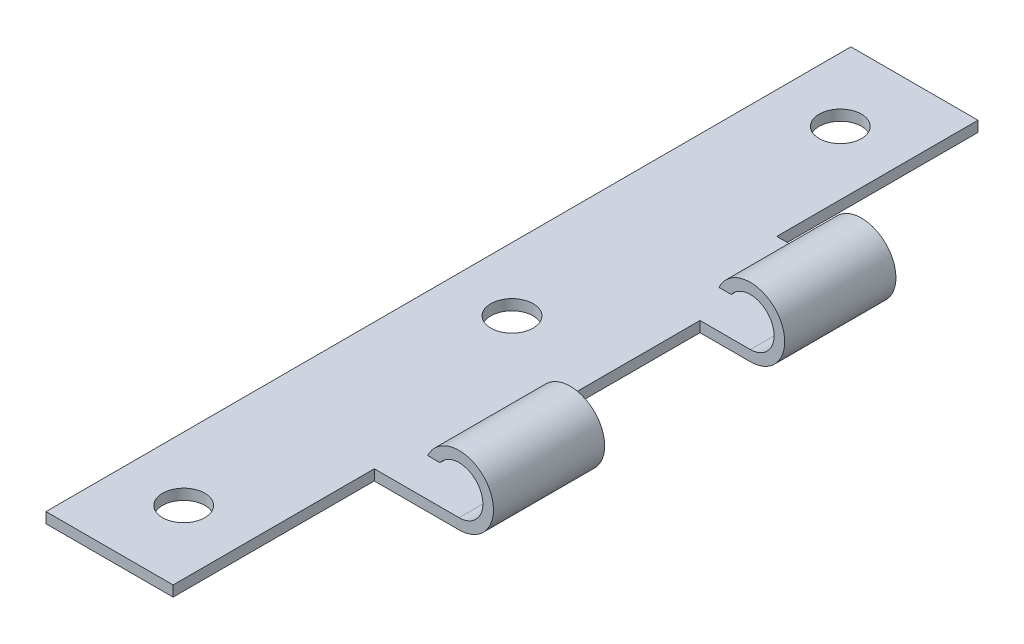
ISO-10303-21;
HEADER;
FILE_DESCRIPTION(('STEP AP214'),'2;1');
FILE_NAME('part.step','',(''),(''),'','','');
FILE_SCHEMA(('AUTOMOTIVE_DESIGN { 1 0 10303 214 1 1 1 1 }'));
ENDSEC;
DATA;
#1=APPLICATION_CONTEXT('core data for automotive mechanical design processes');
#2=APPLICATION_PROTOCOL_DEFINITION('international standard','automotive_design',2000,#1);
#3=PRODUCT_CONTEXT('',#1,'mechanical');
#4=PRODUCT('Part','Part','',(#3));
#5=PRODUCT_RELATED_PRODUCT_CATEGORY('part','',(#4));
#6=PRODUCT_DEFINITION_FORMATION('','',#4);
#7=PRODUCT_DEFINITION_CONTEXT('part definition',#1,'design');
#8=PRODUCT_DEFINITION('design','',#6,#7);
#9=PRODUCT_DEFINITION_SHAPE('','',#8);
#10=(LENGTH_UNIT() NAMED_UNIT(*) SI_UNIT(.MILLI.,.METRE.));
#11=(NAMED_UNIT(*) PLANE_ANGLE_UNIT() SI_UNIT($,.RADIAN.));
#12=(NAMED_UNIT(*) SI_UNIT($,.STERADIAN.) SOLID_ANGLE_UNIT());
#13=UNCERTAINTY_MEASURE_WITH_UNIT(LENGTH_MEASURE(1.E-05),#10,'distance_accuracy_value','');
#14=(GEOMETRIC_REPRESENTATION_CONTEXT(3) GLOBAL_UNCERTAINTY_ASSIGNED_CONTEXT((#13)) GLOBAL_UNIT_ASSIGNED_CONTEXT((#10,
#11,#12)) REPRESENTATION_CONTEXT('',''));
#15=CARTESIAN_POINT('',(0.,0.,0.));
#16=DIRECTION('',(0.,0.,1.));
#17=DIRECTION('',(1.,0.,0.));
#18=AXIS2_PLACEMENT_3D('',#15,#16,#17);
#19=CARTESIAN_POINT('',(-20.,-2.25,58.0249843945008));
#20=DIRECTION('',(0.,-1.,0.));
#21=DIRECTION('',(0.,0.,-1.));
#22=AXIS2_PLACEMENT_3D('',#19,#20,#21);
#23=PLANE('',#22);
#24=CARTESIAN_POINT('',(-14.,-2.25,-31.));
#25=DIRECTION('',(0.,1.,0.));
#26=DIRECTION('',(0.,0.,1.));
#27=AXIS2_PLACEMENT_3D('',#24,#25,#26);
#28=CIRCLE('',#27,2.);
#29=CARTESIAN_POINT('',(-14.,-2.25,-29.));
#30=VERTEX_POINT('',#29);
#31=EDGE_CURVE('E466',#30,#30,#28,.T.);
#32=ORIENTED_EDGE('',*,*,#31,.F.);
#33=EDGE_LOOP('',(#32));
#34=FACE_BOUND('',#33,.T.);
#35=CARTESIAN_POINT('',(-14.,-2.25,0.));
#36=DIRECTION('',(0.,1.,0.));
#37=DIRECTION('',(0.,0.,1.));
#38=AXIS2_PLACEMENT_3D('',#35,#36,#37);
#39=CIRCLE('',#38,2.);
#40=CARTESIAN_POINT('',(-14.,-2.25,2.));
#41=VERTEX_POINT('',#40);
#42=EDGE_CURVE('E468',#41,#41,#39,.T.);
#43=ORIENTED_EDGE('',*,*,#42,.F.);
#44=EDGE_LOOP('',(#43));
#45=FACE_BOUND('',#44,.T.);
#46=DIRECTION('',(-1.,0.,0.));
#47=VECTOR('',#46,1.);
#48=CARTESIAN_POINT('',(-20.,-2.25,38.));
#49=LINE('',#48,#47);
#50=CARTESIAN_POINT('',(-8.,-2.25,38.));
#51=VERTEX_POINT('',#50);
#52=CARTESIAN_POINT('',(-20.,-2.25,38.));
#53=VERTEX_POINT('',#52);
#54=EDGE_CURVE('E174',#51,#53,#49,.T.);
#55=ORIENTED_EDGE('',*,*,#54,.F.);
#56=DIRECTION('',(0.,0.,-1.));
#57=VECTOR('',#56,1.);
#58=CARTESIAN_POINT('',(-8.,-2.25,58.0249843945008));
#59=LINE('',#58,#57);
#60=CARTESIAN_POINT('',(-8.,-2.25,19.));
#61=VERTEX_POINT('',#60);
#62=EDGE_CURVE('E148',#51,#61,#59,.T.);
#63=ORIENTED_EDGE('',*,*,#62,.T.);
#64=DIRECTION('',(1.,0.,0.));
#65=VECTOR('',#64,1.);
#66=CARTESIAN_POINT('',(-20.,-2.25,19.));
#67=LINE('',#66,#65);
#68=CARTESIAN_POINT('',(0.,-2.25,19.));
#69=VERTEX_POINT('',#68);
#70=EDGE_CURVE('E152',#61,#69,#67,.T.);
#71=ORIENTED_EDGE('',*,*,#70,.T.);
#72=DIRECTION('',(0.,0.,1.));
#73=VECTOR('',#72,1.);
#74=CARTESIAN_POINT('',(0.,-2.25,-38.001));
#75=LINE('',#74,#73);
#76=CARTESIAN_POINT('',(0.,-2.25,8.5));
#77=VERTEX_POINT('',#76);
#78=EDGE_CURVE('E230',#77,#69,#75,.T.);
#79=ORIENTED_EDGE('',*,*,#78,.F.);
#80=DIRECTION('',(-1.,0.,0.));
#81=VECTOR('',#80,1.);
#82=CARTESIAN_POINT('',(-20.,-2.25,8.5));
#83=LINE('',#82,#81);
#84=CARTESIAN_POINT('',(-4.75,-2.25,8.5));
#85=VERTEX_POINT('',#84);
#86=EDGE_CURVE('E283',#77,#85,#83,.T.);
#87=ORIENTED_EDGE('',*,*,#86,.T.);
#88=DIRECTION('',(0.,0.,-1.));
#89=VECTOR('',#88,1.);
#90=CARTESIAN_POINT('',(-4.75000000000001,-2.25,58.0249843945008));
#91=LINE('',#90,#89);
#92=CARTESIAN_POINT('',(-4.75,-2.25,-8.5));
#93=VERTEX_POINT('',#92);
#94=EDGE_CURVE('E289',#85,#93,#91,.T.);
#95=ORIENTED_EDGE('',*,*,#94,.T.);
#96=DIRECTION('',(1.,0.,0.));
#97=VECTOR('',#96,1.);
#98=CARTESIAN_POINT('',(-20.,-2.25,-8.5));
#99=LINE('',#98,#97);
#100=CARTESIAN_POINT('',(0.,-2.25,-8.5));
#101=VERTEX_POINT('',#100);
#102=EDGE_CURVE('E278',#93,#101,#99,.T.);
#103=ORIENTED_EDGE('',*,*,#102,.T.);
#104=CARTESIAN_POINT('',(0.,-2.25,-19.));
#105=VERTEX_POINT('',#104);
#106=EDGE_CURVE('E233',#105,#101,#75,.T.);
#107=ORIENTED_EDGE('',*,*,#106,.F.);
#108=DIRECTION('',(-1.,0.,0.));
#109=VECTOR('',#108,1.);
#110=CARTESIAN_POINT('',(-20.,-2.25,-19.));
#111=LINE('',#110,#109);
#112=CARTESIAN_POINT('',(-8.,-2.25,-19.));
#113=VERTEX_POINT('',#112);
#114=EDGE_CURVE('E227',#105,#113,#111,.T.);
#115=ORIENTED_EDGE('',*,*,#114,.T.);
#116=DIRECTION('',(0.,0.,-1.));
#117=VECTOR('',#116,1.);
#118=CARTESIAN_POINT('',(-8.,-2.25,58.0249843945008));
#119=LINE('',#118,#117);
#120=CARTESIAN_POINT('',(-8.,-2.25,-38.));
#121=VERTEX_POINT('',#120);
#122=EDGE_CURVE('E225',#113,#121,#119,.T.);
#123=ORIENTED_EDGE('',*,*,#122,.T.);
#124=DIRECTION('',(1.,0.,0.));
#125=VECTOR('',#124,1.);
#126=CARTESIAN_POINT('',(-20.,-2.25,-38.));
#127=LINE('',#126,#125);
#128=CARTESIAN_POINT('',(-20.,-2.25,-38.));
#129=VERTEX_POINT('',#128);
#130=EDGE_CURVE('E202',#129,#121,#127,.T.);
#131=ORIENTED_EDGE('',*,*,#130,.F.);
#132=DIRECTION('',(0.,0.,-1.));
#133=VECTOR('',#132,1.);
#134=CARTESIAN_POINT('',(-20.,-2.25,58.0249843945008));
#135=LINE('',#134,#133);
#136=EDGE_CURVE('E185',#53,#129,#135,.T.);
#137=ORIENTED_EDGE('',*,*,#136,.F.);
#138=EDGE_LOOP('',(#55,#63,#71,#79,#87,#95,#103,#107,#115,#123,#131,#137));
#139=FACE_BOUND('',#138,.T.);
#140=CARTESIAN_POINT('',(-14.,-2.25,31.));
#141=DIRECTION('',(0.,1.,0.));
#142=DIRECTION('',(0.,0.,1.));
#143=AXIS2_PLACEMENT_3D('',#140,#141,#142);
#144=CIRCLE('',#143,2.);
#145=CARTESIAN_POINT('',(-14.,-2.25,33.));
#146=VERTEX_POINT('',#145);
#147=EDGE_CURVE('E476',#146,#146,#144,.T.);
#148=ORIENTED_EDGE('',*,*,#147,.F.);
#149=EDGE_LOOP('',(#148));
#150=FACE_BOUND('',#149,.T.);
#151=ADVANCED_FACE('F33',(#34,#45,#139,#150),#23,.F.);
#152=CARTESIAN_POINT('',(0.,0.,38.));
#153=DIRECTION('',(0.,0.,-1.));
#154=DIRECTION('',(-1.,0.,0.));
#155=AXIS2_PLACEMENT_3D('',#152,#153,#154);
#156=CYLINDRICAL_SURFACE('',#155,3.25);
#157=DIRECTION('',(0.,0.,-1.));
#158=VECTOR('',#157,1.);
#159=CARTESIAN_POINT('',(-2.9563490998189,1.35,38.));
#160=LINE('',#159,#158);
#161=CARTESIAN_POINT('',(-2.9563490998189,1.35,19.));
#162=VERTEX_POINT('',#161);
#163=CARTESIAN_POINT('',(-2.9563490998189,1.35,8.5));
#164=VERTEX_POINT('',#163);
#165=EDGE_CURVE('E200',#162,#164,#160,.T.);
#166=ORIENTED_EDGE('',*,*,#165,.F.);
#167=CARTESIAN_POINT('',(0.,0.,19.));
#168=DIRECTION('',(0.,0.,-1.));
#169=DIRECTION('',(-1.,0.,0.));
#170=AXIS2_PLACEMENT_3D('',#167,#168,#169);
#171=CIRCLE('',#170,3.25);
#172=CARTESIAN_POINT('',(0.,-3.25,19.));
#173=VERTEX_POINT('',#172);
#174=EDGE_CURVE('E257',#162,#173,#171,.T.);
#175=ORIENTED_EDGE('',*,*,#174,.T.);
#176=DIRECTION('',(0.,0.,-1.));
#177=VECTOR('',#176,1.);
#178=CARTESIAN_POINT('',(0.,-3.25,58.0249843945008));
#179=LINE('',#178,#177);
#180=CARTESIAN_POINT('',(0.,-3.25,8.5));
#181=VERTEX_POINT('',#180);
#182=EDGE_CURVE('E181',#173,#181,#179,.T.);
#183=ORIENTED_EDGE('',*,*,#182,.T.);
#184=CARTESIAN_POINT('',(0.,0.,8.5));
#185=DIRECTION('',(0.,0.,1.));
#186=DIRECTION('',(1.,0.,0.));
#187=AXIS2_PLACEMENT_3D('',#184,#185,#186);
#188=CIRCLE('',#187,3.25);
#189=EDGE_CURVE('E286',#181,#164,#188,.T.);
#190=ORIENTED_EDGE('',*,*,#189,.T.);
#191=EDGE_LOOP('',(#166,#175,#183,#190));
#192=FACE_BOUND('',#191,.T.);
#193=ADVANCED_FACE('F324',(#192),#156,.T.);
#194=CARTESIAN_POINT('',(0.,0.,-38.001));
#195=DIRECTION('',(0.,0.,1.));
#196=DIRECTION('',(1.,0.,0.));
#197=AXIS2_PLACEMENT_3D('',#194,#195,#196);
#198=CYLINDRICAL_SURFACE('',#197,2.25);
#199=ORIENTED_EDGE('',*,*,#78,.T.);
#200=CARTESIAN_POINT('',(0.,0.,19.));
#201=DIRECTION('',(0.,0.,-1.));
#202=DIRECTION('',(-1.,0.,0.));
#203=AXIS2_PLACEMENT_3D('',#200,#201,#202);
#204=CIRCLE('',#203,2.25);
#205=CARTESIAN_POINT('',(-1.8,1.35,19.));
#206=VERTEX_POINT('',#205);
#207=EDGE_CURVE('E253',#69,#206,#204,.F.);
#208=ORIENTED_EDGE('',*,*,#207,.T.);
#209=DIRECTION('',(0.,0.,1.));
#210=VECTOR('',#209,1.);
#211=CARTESIAN_POINT('',(-1.8,1.35,-38.001));
#212=LINE('',#211,#210);
#213=CARTESIAN_POINT('',(-1.8,1.35,8.5));
#214=VERTEX_POINT('',#213);
#215=EDGE_CURVE('E203',#214,#206,#212,.T.);
#216=ORIENTED_EDGE('',*,*,#215,.F.);
#217=CARTESIAN_POINT('',(0.,0.,8.5));
#218=DIRECTION('',(0.,0.,1.));
#219=DIRECTION('',(1.,0.,0.));
#220=AXIS2_PLACEMENT_3D('',#217,#218,#219);
#221=CIRCLE('',#220,2.25);
#222=EDGE_CURVE('E251',#214,#77,#221,.F.);
#223=ORIENTED_EDGE('',*,*,#222,.T.);
#224=EDGE_LOOP('',(#199,#208,#216,#223));
#225=FACE_BOUND('',#224,.T.);
#226=ADVANCED_FACE('F250',(#225),#198,.F.);
#227=CARTESIAN_POINT('',(-3.25,1.35,-38.001));
#228=DIRECTION('',(0.,1.,0.));
#229=DIRECTION('',(0.,0.,1.));
#230=AXIS2_PLACEMENT_3D('',#227,#228,#229);
#231=PLANE('',#230);
#232=ORIENTED_EDGE('',*,*,#215,.T.);
#233=DIRECTION('',(-1.,0.,0.));
#234=VECTOR('',#233,1.);
#235=CARTESIAN_POINT('',(-3.25,1.35,19.));
#236=LINE('',#235,#234);
#237=EDGE_CURVE('E244',#206,#162,#236,.T.);
#238=ORIENTED_EDGE('',*,*,#237,.T.);
#239=ORIENTED_EDGE('',*,*,#165,.T.);
#240=DIRECTION('',(1.,0.,0.));
#241=VECTOR('',#240,1.);
#242=CARTESIAN_POINT('',(-3.25,1.35,8.5));
#243=LINE('',#242,#241);
#244=EDGE_CURVE('E11',#164,#214,#243,.T.);
#245=ORIENTED_EDGE('',*,*,#244,.T.);
#246=EDGE_LOOP('',(#232,#238,#239,#245));
#247=FACE_BOUND('',#246,.T.);
#248=ADVANCED_FACE('F243',(#247),#231,.F.);
#249=CARTESIAN_POINT('',(-2.9563490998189,1.35,-8.5));
#250=VERTEX_POINT('',#249);
#251=CARTESIAN_POINT('',(-2.9563490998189,1.35,-19.));
#252=VERTEX_POINT('',#251);
#253=EDGE_CURVE('E191',#250,#252,#160,.T.);
#254=ORIENTED_EDGE('',*,*,#253,.F.);
#255=CARTESIAN_POINT('',(0.,0.,-8.5));
#256=DIRECTION('',(0.,0.,-1.));
#257=DIRECTION('',(-1.,0.,0.));
#258=AXIS2_PLACEMENT_3D('',#255,#256,#257);
#259=CIRCLE('',#258,3.25);
#260=CARTESIAN_POINT('',(0.,-3.25,-8.5));
#261=VERTEX_POINT('',#260);
#262=EDGE_CURVE('E56',#250,#261,#259,.T.);
#263=ORIENTED_EDGE('',*,*,#262,.T.);
#264=CARTESIAN_POINT('',(0.,-3.25,-19.));
#265=VERTEX_POINT('',#264);
#266=EDGE_CURVE('E184',#261,#265,#179,.T.);
#267=ORIENTED_EDGE('',*,*,#266,.T.);
#268=CARTESIAN_POINT('',(0.,0.,-19.));
#269=DIRECTION('',(0.,0.,1.));
#270=DIRECTION('',(1.,0.,0.));
#271=AXIS2_PLACEMENT_3D('',#268,#269,#270);
#272=CIRCLE('',#271,3.25);
#273=EDGE_CURVE('E198',#265,#252,#272,.T.);
#274=ORIENTED_EDGE('',*,*,#273,.T.);
#275=EDGE_LOOP('',(#254,#263,#267,#274));
#276=FACE_BOUND('',#275,.T.);
#277=ADVANCED_FACE('F35',(#276),#156,.T.);
#278=CARTESIAN_POINT('',(0.,0.,38.));
#279=DIRECTION('',(0.,0.,1.));
#280=DIRECTION('',(1.,0.,0.));
#281=AXIS2_PLACEMENT_3D('',#278,#279,#280);
#282=PLANE('',#281);
#283=DIRECTION('',(0.,-1.,0.));
#284=VECTOR('',#283,1.);
#285=CARTESIAN_POINT('',(-8.,3.25,38.));
#286=LINE('',#285,#284);
#287=CARTESIAN_POINT('',(-8.,-3.25,38.));
#288=VERTEX_POINT('',#287);
#289=EDGE_CURVE('E145',#51,#288,#286,.T.);
#290=ORIENTED_EDGE('',*,*,#289,.F.);
#291=ORIENTED_EDGE('',*,*,#54,.T.);
#292=DIRECTION('',(0.,-1.,0.));
#293=VECTOR('',#292,1.);
#294=CARTESIAN_POINT('',(-20.,-2.25,38.));
#295=LINE('',#294,#293);
#296=CARTESIAN_POINT('',(-20.,-3.25,38.));
#297=VERTEX_POINT('',#296);
#298=EDGE_CURVE('E169',#53,#297,#295,.T.);
#299=ORIENTED_EDGE('',*,*,#298,.T.);
#300=DIRECTION('',(1.,0.,0.));
#301=VECTOR('',#300,1.);
#302=CARTESIAN_POINT('',(-20.,-3.25,38.));
#303=LINE('',#302,#301);
#304=EDGE_CURVE('E159',#297,#288,#303,.T.);
#305=ORIENTED_EDGE('',*,*,#304,.T.);
#306=EDGE_LOOP('',(#290,#291,#299,#305));
#307=FACE_BOUND('',#306,.T.);
#308=ADVANCED_FACE('F167',(#307),#282,.T.);
#309=CARTESIAN_POINT('',(0.,0.,-38.));
#310=DIRECTION('',(0.,0.,1.));
#311=DIRECTION('',(1.,0.,0.));
#312=AXIS2_PLACEMENT_3D('',#309,#310,#311);
#313=PLANE('',#312);
#314=ORIENTED_EDGE('',*,*,#130,.T.);
#315=DIRECTION('',(0.,-1.,0.));
#316=VECTOR('',#315,1.);
#317=CARTESIAN_POINT('',(-8.,3.25,-38.));
#318=LINE('',#317,#316);
#319=CARTESIAN_POINT('',(-8.,-3.25,-38.));
#320=VERTEX_POINT('',#319);
#321=EDGE_CURVE('E216',#121,#320,#318,.T.);
#322=ORIENTED_EDGE('',*,*,#321,.T.);
#323=DIRECTION('',(-1.,0.,0.));
#324=VECTOR('',#323,1.);
#325=CARTESIAN_POINT('',(-20.,-3.25,-38.));
#326=LINE('',#325,#324);
#327=CARTESIAN_POINT('',(-20.,-3.25,-38.));
#328=VERTEX_POINT('',#327);
#329=EDGE_CURVE('E177',#320,#328,#326,.T.);
#330=ORIENTED_EDGE('',*,*,#329,.T.);
#331=DIRECTION('',(0.,1.,0.));
#332=VECTOR('',#331,1.);
#333=CARTESIAN_POINT('',(-20.,-2.25,-38.));
#334=LINE('',#333,#332);
#335=EDGE_CURVE('E208',#328,#129,#334,.T.);
#336=ORIENTED_EDGE('',*,*,#335,.T.);
#337=EDGE_LOOP('',(#314,#322,#330,#336));
#338=FACE_BOUND('',#337,.T.);
#339=ADVANCED_FACE('F215',(#338),#313,.F.);
#340=CARTESIAN_POINT('',(-20.,-2.25,58.0249843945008));
#341=DIRECTION('',(1.,0.,0.));
#342=DIRECTION('',(0.,0.,-1.));
#343=AXIS2_PLACEMENT_3D('',#340,#341,#342);
#344=PLANE('',#343);
#345=ORIENTED_EDGE('',*,*,#298,.F.);
#346=ORIENTED_EDGE('',*,*,#136,.T.);
#347=ORIENTED_EDGE('',*,*,#335,.F.);
#348=DIRECTION('',(0.,0.,-1.));
#349=VECTOR('',#348,1.);
#350=CARTESIAN_POINT('',(-20.,-3.25,58.0249843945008));
#351=LINE('',#350,#349);
#352=EDGE_CURVE('E182',#297,#328,#351,.T.);
#353=ORIENTED_EDGE('',*,*,#352,.F.);
#354=EDGE_LOOP('',(#345,#346,#347,#353));
#355=FACE_BOUND('',#354,.T.);
#356=ADVANCED_FACE('F219',(#355),#344,.F.);
#357=CARTESIAN_POINT('',(-20.,-3.25,58.0249843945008));
#358=DIRECTION('',(0.,1.,0.));
#359=DIRECTION('',(0.,0.,1.));
#360=AXIS2_PLACEMENT_3D('',#357,#358,#359);
#361=PLANE('',#360);
#362=CARTESIAN_POINT('',(-14.,-3.25,-31.));
#363=DIRECTION('',(0.,1.,0.));
#364=DIRECTION('',(0.,0.,1.));
#365=AXIS2_PLACEMENT_3D('',#362,#363,#364);
#366=CIRCLE('',#365,2.);
#367=CARTESIAN_POINT('',(-14.,-3.25,-29.));
#368=VERTEX_POINT('',#367);
#369=EDGE_CURVE('E464',#368,#368,#366,.T.);
#370=ORIENTED_EDGE('',*,*,#369,.T.);
#371=EDGE_LOOP('',(#370));
#372=FACE_BOUND('',#371,.T.);
#373=CARTESIAN_POINT('',(-14.,-3.25,0.));
#374=DIRECTION('',(0.,1.,0.));
#375=DIRECTION('',(0.,0.,1.));
#376=AXIS2_PLACEMENT_3D('',#373,#374,#375);
#377=CIRCLE('',#376,2.);
#378=CARTESIAN_POINT('',(-14.,-3.25,2.));
#379=VERTEX_POINT('',#378);
#380=EDGE_CURVE('E473',#379,#379,#377,.T.);
#381=ORIENTED_EDGE('',*,*,#380,.T.);
#382=EDGE_LOOP('',(#381));
#383=FACE_BOUND('',#382,.T.);
#384=CARTESIAN_POINT('',(-14.,-3.25,31.));
#385=DIRECTION('',(0.,1.,0.));
#386=DIRECTION('',(0.,0.,1.));
#387=AXIS2_PLACEMENT_3D('',#384,#385,#386);
#388=CIRCLE('',#387,2.);
#389=CARTESIAN_POINT('',(-14.,-3.25,33.));
#390=VERTEX_POINT('',#389);
#391=EDGE_CURVE('E164',#390,#390,#388,.T.);
#392=ORIENTED_EDGE('',*,*,#391,.T.);
#393=EDGE_LOOP('',(#392));
#394=FACE_BOUND('',#393,.T.);
#395=DIRECTION('',(1.,0.,0.));
#396=VECTOR('',#395,1.);
#397=CARTESIAN_POINT('',(-8.,-3.25,19.));
#398=LINE('',#397,#396);
#399=CARTESIAN_POINT('',(-8.,-3.25,19.));
#400=VERTEX_POINT('',#399);
#401=EDGE_CURVE('E163',#400,#173,#398,.T.);
#402=ORIENTED_EDGE('',*,*,#401,.F.);
#403=DIRECTION('',(0.,0.,-1.));
#404=VECTOR('',#403,1.);
#405=CARTESIAN_POINT('',(-8.,-3.25,19.));
#406=LINE('',#405,#404);
#407=EDGE_CURVE('E48',#288,#400,#406,.T.);
#408=ORIENTED_EDGE('',*,*,#407,.F.);
#409=ORIENTED_EDGE('',*,*,#304,.F.);
#410=ORIENTED_EDGE('',*,*,#352,.T.);
#411=ORIENTED_EDGE('',*,*,#329,.F.);
#412=DIRECTION('',(0.,0.,-1.));
#413=VECTOR('',#412,1.);
#414=CARTESIAN_POINT('',(-8.,-3.25,-38.));
#415=LINE('',#414,#413);
#416=CARTESIAN_POINT('',(-8.,-3.25,-19.));
#417=VERTEX_POINT('',#416);
#418=EDGE_CURVE('E292',#417,#320,#415,.T.);
#419=ORIENTED_EDGE('',*,*,#418,.F.);
#420=DIRECTION('',(-1.,0.,0.));
#421=VECTOR('',#420,1.);
#422=CARTESIAN_POINT('',(-8.,-3.25,-19.));
#423=LINE('',#422,#421);
#424=EDGE_CURVE('E294',#265,#417,#423,.T.);
#425=ORIENTED_EDGE('',*,*,#424,.F.);
#426=ORIENTED_EDGE('',*,*,#266,.F.);
#427=DIRECTION('',(1.,0.,0.));
#428=VECTOR('',#427,1.);
#429=CARTESIAN_POINT('',(-4.75,-3.25,-8.5));
#430=LINE('',#429,#428);
#431=CARTESIAN_POINT('',(-4.75,-3.25,-8.5));
#432=VERTEX_POINT('',#431);
#433=EDGE_CURVE('E267',#432,#261,#430,.T.);
#434=ORIENTED_EDGE('',*,*,#433,.F.);
#435=DIRECTION('',(0.,0.,-1.));
#436=VECTOR('',#435,1.);
#437=CARTESIAN_POINT('',(-4.75,-3.25,-8.5));
#438=LINE('',#437,#436);
#439=CARTESIAN_POINT('',(-4.75,-3.25,8.5));
#440=VERTEX_POINT('',#439);
#441=EDGE_CURVE('E264',#440,#432,#438,.T.);
#442=ORIENTED_EDGE('',*,*,#441,.F.);
#443=DIRECTION('',(-1.,0.,0.));
#444=VECTOR('',#443,1.);
#445=CARTESIAN_POINT('',(-4.75,-3.25,8.5));
#446=LINE('',#445,#444);
#447=EDGE_CURVE('E269',#181,#440,#446,.T.);
#448=ORIENTED_EDGE('',*,*,#447,.F.);
#449=ORIENTED_EDGE('',*,*,#182,.F.);
#450=EDGE_LOOP('',(#402,#408,#409,#410,#411,#419,#425,#426,#434,#442,#448,#449));
#451=FACE_BOUND('',#450,.T.);
#452=ADVANCED_FACE('F157',(#372,#383,#394,#451),#361,.F.);
#453=ORIENTED_EDGE('',*,*,#106,.T.);
#454=CARTESIAN_POINT('',(0.,0.,-8.5));
#455=DIRECTION('',(0.,0.,-1.));
#456=DIRECTION('',(-1.,0.,0.));
#457=AXIS2_PLACEMENT_3D('',#454,#455,#456);
#458=CIRCLE('',#457,2.25);
#459=CARTESIAN_POINT('',(-1.8,1.35,-8.5));
#460=VERTEX_POINT('',#459);
#461=EDGE_CURVE('E275',#101,#460,#458,.F.);
#462=ORIENTED_EDGE('',*,*,#461,.T.);
#463=CARTESIAN_POINT('',(-1.8,1.35,-19.));
#464=VERTEX_POINT('',#463);
#465=EDGE_CURVE('E194',#464,#460,#212,.T.);
#466=ORIENTED_EDGE('',*,*,#465,.F.);
#467=CARTESIAN_POINT('',(0.,0.,-19.));
#468=DIRECTION('',(0.,0.,1.));
#469=DIRECTION('',(1.,0.,0.));
#470=AXIS2_PLACEMENT_3D('',#467,#468,#469);
#471=CIRCLE('',#470,2.25);
#472=EDGE_CURVE('E299',#464,#105,#471,.F.);
#473=ORIENTED_EDGE('',*,*,#472,.T.);
#474=EDGE_LOOP('',(#453,#462,#466,#473));
#475=FACE_BOUND('',#474,.T.);
#476=ADVANCED_FACE('F301',(#475),#198,.F.);
#477=ORIENTED_EDGE('',*,*,#465,.T.);
#478=DIRECTION('',(-1.,0.,0.));
#479=VECTOR('',#478,1.);
#480=CARTESIAN_POINT('',(-3.25,1.35,-8.5));
#481=LINE('',#480,#479);
#482=EDGE_CURVE('E41',#460,#250,#481,.T.);
#483=ORIENTED_EDGE('',*,*,#482,.T.);
#484=ORIENTED_EDGE('',*,*,#253,.T.);
#485=DIRECTION('',(1.,0.,0.));
#486=VECTOR('',#485,1.);
#487=CARTESIAN_POINT('',(-3.25,1.35,-19.));
#488=LINE('',#487,#486);
#489=EDGE_CURVE('E170',#252,#464,#488,.T.);
#490=ORIENTED_EDGE('',*,*,#489,.T.);
#491=EDGE_LOOP('',(#477,#483,#484,#490));
#492=FACE_BOUND('',#491,.T.);
#493=ADVANCED_FACE('F190',(#492),#231,.F.);
#494=CARTESIAN_POINT('',(-8.,3.25,-38.));
#495=DIRECTION('',(-1.,0.,0.));
#496=DIRECTION('',(0.,0.,1.));
#497=AXIS2_PLACEMENT_3D('',#494,#495,#496);
#498=PLANE('',#497);
#499=DIRECTION('',(0.,-1.,0.));
#500=VECTOR('',#499,1.);
#501=CARTESIAN_POINT('',(-8.,3.25,-19.));
#502=LINE('',#501,#500);
#503=EDGE_CURVE('E297',#113,#417,#502,.T.);
#504=ORIENTED_EDGE('',*,*,#503,.T.);
#505=ORIENTED_EDGE('',*,*,#418,.T.);
#506=ORIENTED_EDGE('',*,*,#321,.F.);
#507=ORIENTED_EDGE('',*,*,#122,.F.);
#508=EDGE_LOOP('',(#504,#505,#506,#507));
#509=FACE_BOUND('',#508,.T.);
#510=ADVANCED_FACE('F314',(#509),#498,.F.);
#511=CARTESIAN_POINT('',(-8.,3.25,-19.));
#512=DIRECTION('',(0.,0.,1.));
#513=DIRECTION('',(1.,0.,0.));
#514=AXIS2_PLACEMENT_3D('',#511,#512,#513);
#515=PLANE('',#514);
#516=ORIENTED_EDGE('',*,*,#424,.T.);
#517=ORIENTED_EDGE('',*,*,#503,.F.);
#518=ORIENTED_EDGE('',*,*,#114,.F.);
#519=ORIENTED_EDGE('',*,*,#472,.F.);
#520=ORIENTED_EDGE('',*,*,#489,.F.);
#521=ORIENTED_EDGE('',*,*,#273,.F.);
#522=EDGE_LOOP('',(#516,#517,#518,#519,#520,#521));
#523=FACE_BOUND('',#522,.T.);
#524=ADVANCED_FACE('F313',(#523),#515,.F.);
#525=CARTESIAN_POINT('',(-4.75,3.25,-8.5));
#526=DIRECTION('',(-1.,0.,0.));
#527=DIRECTION('',(0.,0.,1.));
#528=AXIS2_PLACEMENT_3D('',#525,#526,#527);
#529=PLANE('',#528);
#530=DIRECTION('',(0.,-1.,0.));
#531=VECTOR('',#530,1.);
#532=CARTESIAN_POINT('',(-4.75,3.25,8.5));
#533=LINE('',#532,#531);
#534=EDGE_CURVE('E273',#85,#440,#533,.T.);
#535=ORIENTED_EDGE('',*,*,#534,.T.);
#536=ORIENTED_EDGE('',*,*,#441,.T.);
#537=DIRECTION('',(0.,-1.,0.));
#538=VECTOR('',#537,1.);
#539=CARTESIAN_POINT('',(-4.75,3.25,-8.5));
#540=LINE('',#539,#538);
#541=EDGE_CURVE('E272',#93,#432,#540,.T.);
#542=ORIENTED_EDGE('',*,*,#541,.F.);
#543=ORIENTED_EDGE('',*,*,#94,.F.);
#544=EDGE_LOOP('',(#535,#536,#542,#543));
#545=FACE_BOUND('',#544,.T.);
#546=ADVANCED_FACE('F306',(#545),#529,.F.);
#547=CARTESIAN_POINT('',(-4.75,3.25,8.5));
#548=DIRECTION('',(0.,0.,1.));
#549=DIRECTION('',(1.,0.,0.));
#550=AXIS2_PLACEMENT_3D('',#547,#548,#549);
#551=PLANE('',#550);
#552=ORIENTED_EDGE('',*,*,#447,.T.);
#553=ORIENTED_EDGE('',*,*,#534,.F.);
#554=ORIENTED_EDGE('',*,*,#86,.F.);
#555=ORIENTED_EDGE('',*,*,#222,.F.);
#556=ORIENTED_EDGE('',*,*,#244,.F.);
#557=ORIENTED_EDGE('',*,*,#189,.F.);
#558=EDGE_LOOP('',(#552,#553,#554,#555,#556,#557));
#559=FACE_BOUND('',#558,.T.);
#560=ADVANCED_FACE('F387',(#559),#551,.F.);
#561=CARTESIAN_POINT('',(-4.75,3.25,-8.5));
#562=DIRECTION('',(0.,0.,-1.));
#563=DIRECTION('',(-1.,0.,0.));
#564=AXIS2_PLACEMENT_3D('',#561,#562,#563);
#565=PLANE('',#564);
#566=ORIENTED_EDGE('',*,*,#262,.F.);
#567=ORIENTED_EDGE('',*,*,#482,.F.);
#568=ORIENTED_EDGE('',*,*,#461,.F.);
#569=ORIENTED_EDGE('',*,*,#102,.F.);
#570=ORIENTED_EDGE('',*,*,#541,.T.);
#571=ORIENTED_EDGE('',*,*,#433,.T.);
#572=EDGE_LOOP('',(#566,#567,#568,#569,#570,#571));
#573=FACE_BOUND('',#572,.T.);
#574=ADVANCED_FACE('F304',(#573),#565,.F.);
#575=CARTESIAN_POINT('',(-8.,3.25,19.));
#576=DIRECTION('',(-1.,0.,0.));
#577=DIRECTION('',(0.,0.,1.));
#578=AXIS2_PLACEMENT_3D('',#575,#576,#577);
#579=PLANE('',#578);
#580=ORIENTED_EDGE('',*,*,#289,.T.);
#581=ORIENTED_EDGE('',*,*,#407,.T.);
#582=DIRECTION('',(0.,-1.,0.));
#583=VECTOR('',#582,1.);
#584=CARTESIAN_POINT('',(-8.,3.25,19.));
#585=LINE('',#584,#583);
#586=EDGE_CURVE('E153',#61,#400,#585,.T.);
#587=ORIENTED_EDGE('',*,*,#586,.F.);
#588=ORIENTED_EDGE('',*,*,#62,.F.);
#589=EDGE_LOOP('',(#580,#581,#587,#588));
#590=FACE_BOUND('',#589,.T.);
#591=ADVANCED_FACE('F146',(#590),#579,.F.);
#592=CARTESIAN_POINT('',(-8.,3.25,19.));
#593=DIRECTION('',(0.,0.,-1.));
#594=DIRECTION('',(-1.,0.,0.));
#595=AXIS2_PLACEMENT_3D('',#592,#593,#594);
#596=PLANE('',#595);
#597=ORIENTED_EDGE('',*,*,#174,.F.);
#598=ORIENTED_EDGE('',*,*,#237,.F.);
#599=ORIENTED_EDGE('',*,*,#207,.F.);
#600=ORIENTED_EDGE('',*,*,#70,.F.);
#601=ORIENTED_EDGE('',*,*,#586,.T.);
#602=ORIENTED_EDGE('',*,*,#401,.T.);
#603=EDGE_LOOP('',(#597,#598,#599,#600,#601,#602));
#604=FACE_BOUND('',#603,.T.);
#605=ADVANCED_FACE('F413',(#604),#596,.F.);
#606=CARTESIAN_POINT('',(-14.,-2.25,31.));
#607=DIRECTION('',(0.,1.,0.));
#608=DIRECTION('',(0.,0.,1.));
#609=AXIS2_PLACEMENT_3D('',#606,#607,#608);
#610=CYLINDRICAL_SURFACE('',#609,2.);
#611=ORIENTED_EDGE('',*,*,#391,.F.);
#612=EDGE_LOOP('',(#611));
#613=FACE_BOUND('',#612,.T.);
#614=ORIENTED_EDGE('',*,*,#147,.T.);
#615=EDGE_LOOP('',(#614));
#616=FACE_BOUND('',#615,.T.);
#617=ADVANCED_FACE('F421',(#613,#616),#610,.F.);
#618=CARTESIAN_POINT('',(-14.,-2.25,0.));
#619=DIRECTION('',(0.,1.,0.));
#620=DIRECTION('',(0.,0.,1.));
#621=AXIS2_PLACEMENT_3D('',#618,#619,#620);
#622=CYLINDRICAL_SURFACE('',#621,2.);
#623=ORIENTED_EDGE('',*,*,#380,.F.);
#624=EDGE_LOOP('',(#623));
#625=FACE_BOUND('',#624,.T.);
#626=ORIENTED_EDGE('',*,*,#42,.T.);
#627=EDGE_LOOP('',(#626));
#628=FACE_BOUND('',#627,.T.);
#629=ADVANCED_FACE('F438',(#625,#628),#622,.F.);
#630=CARTESIAN_POINT('',(-14.,-2.25,-31.));
#631=DIRECTION('',(0.,1.,0.));
#632=DIRECTION('',(0.,0.,1.));
#633=AXIS2_PLACEMENT_3D('',#630,#631,#632);
#634=CYLINDRICAL_SURFACE('',#633,2.);
#635=ORIENTED_EDGE('',*,*,#369,.F.);
#636=EDGE_LOOP('',(#635));
#637=FACE_BOUND('',#636,.T.);
#638=ORIENTED_EDGE('',*,*,#31,.T.);
#639=EDGE_LOOP('',(#638));
#640=FACE_BOUND('',#639,.T.);
#641=ADVANCED_FACE('F447',(#637,#640),#634,.F.);
#642=CLOSED_SHELL('',(#151,#193,#226,#248,#277,#308,#339,#356,#452,#476,#493,#510,#524,#546,
#560,#574,#591,#605,#617,#629,#641));
#643=MANIFOLD_SOLID_BREP('B2',#642);
#644=ADVANCED_BREP_SHAPE_REPRESENTATION('',(#18,#643),#14);
#645=SHAPE_DEFINITION_REPRESENTATION(#9,#644);
ENDSEC;
END-ISO-10303-21;
